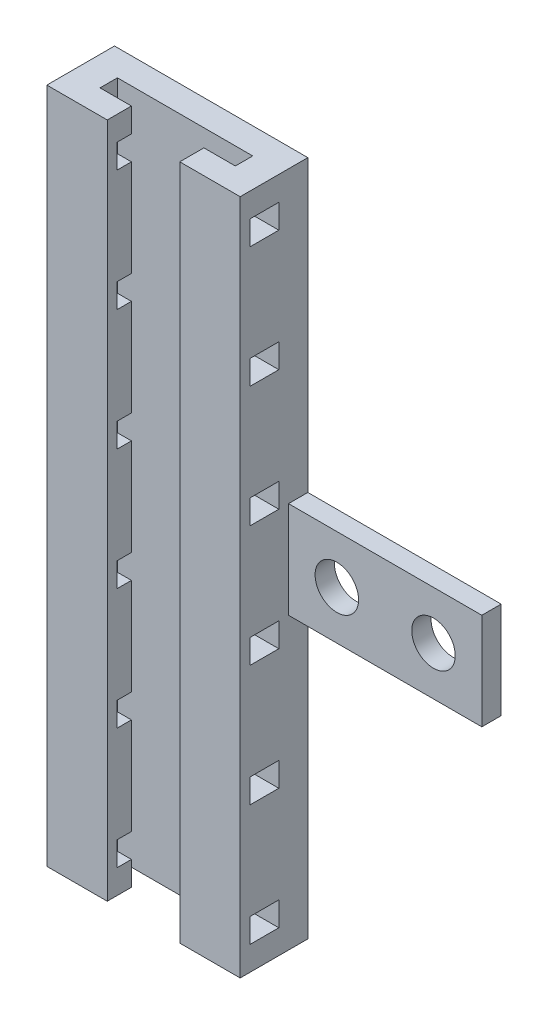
from build123d import *

# Parameters (mm, degrees)
BOSS_EXTRUDE1_DEPTH = 70
SKETCH3_W           = 2
SKETCH3_H           = 10
BOSS_EXTRUDE2_DEPTH = 20
SKETCH4_R           = 2.25
CUT_EXTRUDE2_DEPTH  = 20
SKETCH5_W           = 3
SKETCH5_H           = 2.5
CUT_EXTRUDE3_DEPTH  = 39


with BuildPart() as part:
    # Sketch2 → Boss-Extrude1 (new body)
    with BuildSketch(Plane(origin=(0, 0, 0), x_dir=(1, 0, 0), z_dir=(0, 1, 0))):
        Polygon((3, 2.5), (6.25, 2.5), (6.25, 0), (0, 0), (0, 7), (20, 7), (20, 0), (13.75, 0), (13.75, 2.5), (17, 2.5), (17, 4.3), (3, 4.3), align=None)
    extrude(amount=BOSS_EXTRUDE1_DEPTH)

    # Sketch3 → Boss-Extrude2 (add)
    with BuildSketch(Plane(origin=(20, 0, 0), x_dir=(0, 0, -1), z_dir=(1, 0, 0))):
        with Locations((6, 35)):
            Rectangle(SKETCH3_W, SKETCH3_H)
    extrude(amount=BOSS_EXTRUDE2_DEPTH)

    # Sketch4 → Cut-Extrude2 (cut)
    with BuildSketch(Plane.XY.offset(-5)):
        with Locations((25, 35)):
            Circle(SKETCH4_R)
        with Locations((35, 35)):
            Circle(SKETCH4_R)
    extrude(amount=-CUT_EXTRUDE2_DEPTH, mode=Mode.SUBTRACT)

    # Sketch5 → Cut-Extrude3 (cut)
    with BuildSketch(Plane(origin=(20, 0, 0), x_dir=(0, 0, -1), z_dir=(1, 0, 0))):
        with Locations((2.5, 3.75)):
            Rectangle(SKETCH5_W, SKETCH5_H)
        with Locations((2.5, 16.25)):
            Rectangle(SKETCH5_W, SKETCH5_H)
        with Locations((2.5, 28.75)):
            Rectangle(SKETCH5_W, SKETCH5_H)
        with Locations((2.5, 41.25)):
            Rectangle(SKETCH5_W, SKETCH5_H)
        with Locations((2.5, 53.75)):
            Rectangle(SKETCH5_W, SKETCH5_H)
        with Locations((2.5, 66.25)):
            Rectangle(SKETCH5_W, SKETCH5_H)
    extrude(amount=-CUT_EXTRUDE3_DEPTH, mode=Mode.SUBTRACT)


solid = part.part
